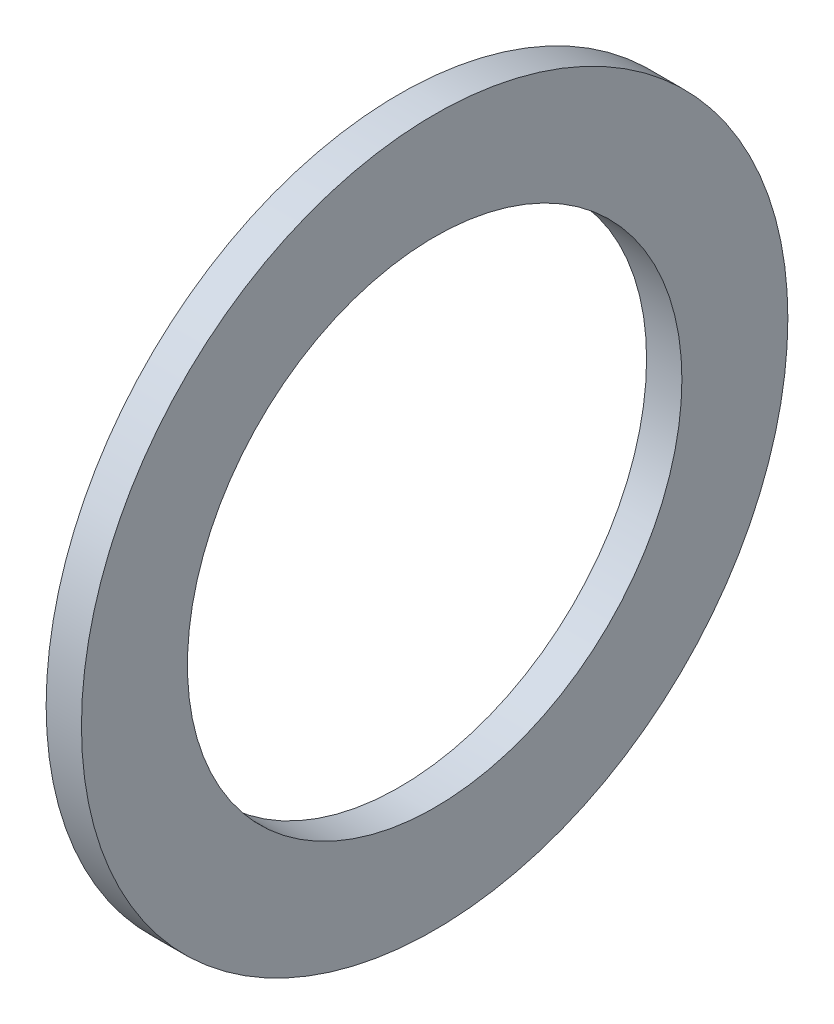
from build123d import *

# Parameters (mm, degrees)
ESQUISSE1_W             = 0.5
ESQUISSE1_H             = 5
ESQUISSE2_R             = 3.5
ENL_V_MAT_EXTRU_2_DEPTH = 10


with BuildPart() as part:
    # Esquisse1 → Base-R_volution (revolve)
    with BuildSketch(Plane.XY, mode=Mode.PRIVATE) as base_r_volution_sk:
        with Locations((-0.25, -2.5)):
            Rectangle(ESQUISSE1_W, ESQUISSE1_H)
    revolve(base_r_volution_sk.sketch.rotate(Axis((0, 0, 0), (-1, 0, 0)), 270), axis=Axis((0, 0, 0), (-1, 0, 0)))

    # Esquisse2 → Enl_v. mat.-Extru.2 (cut)
    with BuildSketch(Plane(origin=(0, 0, 0), x_dir=(0, 0, -1), z_dir=(1, 0, 0))):
        Circle(ESQUISSE2_R)
    extrude(amount=-ENL_V_MAT_EXTRU_2_DEPTH, mode=Mode.SUBTRACT)


solid = part.part
